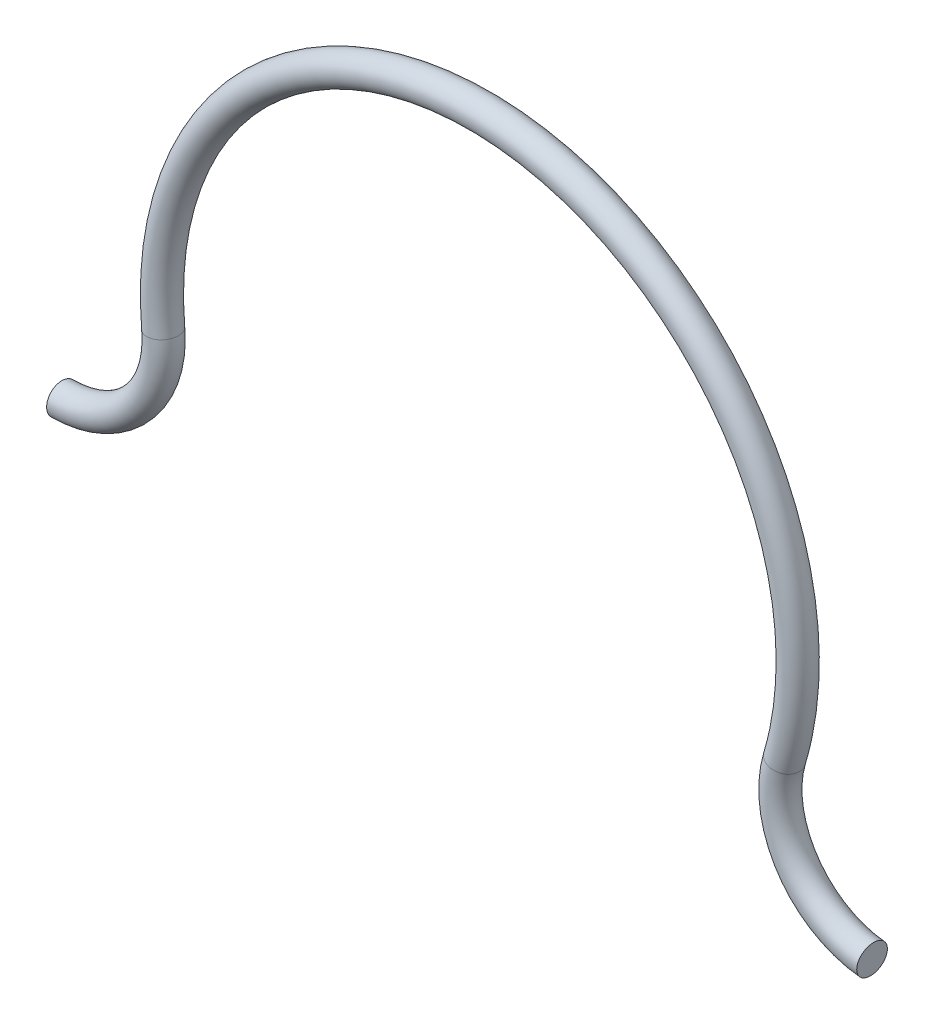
ISO-10303-21;
HEADER;
FILE_DESCRIPTION(('STEP AP214'),'2;1');
FILE_NAME('part.step','',(''),(''),'','','');
FILE_SCHEMA(('AUTOMOTIVE_DESIGN { 1 0 10303 214 1 1 1 1 }'));
ENDSEC;
DATA;
#1=APPLICATION_CONTEXT('core data for automotive mechanical design processes');
#2=APPLICATION_PROTOCOL_DEFINITION('international standard','automotive_design',2000,#1);
#3=PRODUCT_CONTEXT('',#1,'mechanical');
#4=PRODUCT('Part','Part','',(#3));
#5=PRODUCT_RELATED_PRODUCT_CATEGORY('part','',(#4));
#6=PRODUCT_DEFINITION_FORMATION('','',#4);
#7=PRODUCT_DEFINITION_CONTEXT('part definition',#1,'design');
#8=PRODUCT_DEFINITION('design','',#6,#7);
#9=PRODUCT_DEFINITION_SHAPE('','',#8);
#10=(LENGTH_UNIT() NAMED_UNIT(*) SI_UNIT(.MILLI.,.METRE.));
#11=(NAMED_UNIT(*) PLANE_ANGLE_UNIT() SI_UNIT($,.RADIAN.));
#12=(NAMED_UNIT(*) SI_UNIT($,.STERADIAN.) SOLID_ANGLE_UNIT());
#13=UNCERTAINTY_MEASURE_WITH_UNIT(LENGTH_MEASURE(1.E-05),#10,'distance_accuracy_value','');
#14=(GEOMETRIC_REPRESENTATION_CONTEXT(3) GLOBAL_UNCERTAINTY_ASSIGNED_CONTEXT((#13)) GLOBAL_UNIT_ASSIGNED_CONTEXT((#10,
#11,#12)) REPRESENTATION_CONTEXT('',''));
#15=CARTESIAN_POINT('',(0.,0.,0.));
#16=DIRECTION('',(0.,0.,1.));
#17=DIRECTION('',(1.,0.,0.));
#18=AXIS2_PLACEMENT_3D('',#15,#16,#17);
#19=CARTESIAN_POINT('',(805.971377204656,-79.7481080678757,0.));
#20=DIRECTION('',(0.,0.,1.));
#21=DIRECTION('',(1.,0.,0.));
#22=AXIS2_PLACEMENT_3D('',#19,#20,#21);
#23=TOROIDAL_SURFACE('',#22,100.,15.);
#24=CARTESIAN_POINT('',(710.106013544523,-51.2905598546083,0.));
#25=DIRECTION('',(-0.284575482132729,-0.958653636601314,0.));
#26=DIRECTION('',(0.,0.,-1.));
#27=AXIS2_PLACEMENT_3D('',#24,#25,#26);
#28=CIRCLE('',#27,15.);
#29=CARTESIAN_POINT('',(695.726208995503,-47.0219276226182,0.));
#30=VERTEX_POINT('',#29);
#31=EDGE_CURVE('E37',#30,#30,#28,.T.);
#32=CARTESIAN_POINT('',(796.06435810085,-179.256152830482,0.));
#33=DIRECTION('',(0.995080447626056,-0.0990701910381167,0.));
#34=DIRECTION('',(0.,0.,-1.));
#35=AXIS2_PLACEMENT_3D('',#32,#33,#34);
#36=CIRCLE('',#35,15.);
#37=CARTESIAN_POINT('',(794.578305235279,-194.182359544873,0.));
#38=VERTEX_POINT('',#37);
#39=EDGE_CURVE('E10',#38,#38,#36,.T.);
#40=CARTESIAN_POINT('',(805.971377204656,-79.7481080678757,0.));
#41=DIRECTION('',(0.,0.,1.));
#42=DIRECTION('',(1.,0.,0.));
#43=AXIS2_PLACEMENT_3D('',#40,#41,#42);
#44=CIRCLE('',#43,115.);
#45=EDGE_CURVE('',#30,#38,#44,.T.);
#46=ORIENTED_EDGE('',*,*,#31,.T.);
#47=ORIENTED_EDGE('',*,*,#39,.F.);
#48=ORIENTED_EDGE('',*,*,#45,.T.);
#49=ORIENTED_EDGE('',*,*,#45,.F.);
#50=EDGE_LOOP('',(#46,#48,#47,#49));
#51=FACE_BOUND('',#50,.T.);
#52=ADVANCED_FACE('F31',(#51),#23,.T.);
#53=CARTESIAN_POINT('',(410.651697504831,37.6021883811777,0.));
#54=DIRECTION('',(0.,0.,-1.));
#55=DIRECTION('',(-1.,0.,0.));
#56=AXIS2_PLACEMENT_3D('',#53,#54,#55);
#57=TOROIDAL_SURFACE('',#56,312.369665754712,15.);
#58=CARTESIAN_POINT('',(99.5833912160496,9.11856314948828,0.));
#59=DIRECTION('',(-0.0911856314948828,0.995833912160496,0.));
#60=DIRECTION('',(0.,0.,-1.));
#61=AXIS2_PLACEMENT_3D('',#58,#59,#60);
#62=CIRCLE('',#61,15.);
#63=CARTESIAN_POINT('',(114.520899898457,10.4863476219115,0.));
#64=VERTEX_POINT('',#63);
#65=EDGE_CURVE('E41',#64,#64,#62,.T.);
#66=ORIENTED_EDGE('',*,*,#65,.T.);
#67=EDGE_LOOP('',(#66));
#68=FACE_BOUND('',#67,.T.);
#69=ORIENTED_EDGE('',*,*,#31,.F.);
#70=EDGE_LOOP('',(#69));
#71=FACE_BOUND('',#70,.T.);
#72=ADVANCED_FACE('F61',(#68,#71),#57,.T.);
#73=CARTESIAN_POINT('',(0.,0.,0.));
#74=DIRECTION('',(0.,0.,-1.));
#75=DIRECTION('',(-1.,0.,0.));
#76=AXIS2_PLACEMENT_3D('',#73,#74,#75);
#77=TOROIDAL_SURFACE('',#76,100.,15.);
#78=CARTESIAN_POINT('',(0.,-100.,0.));
#79=DIRECTION('',(1.,0.,0.));
#80=DIRECTION('',(0.,0.,-1.));
#81=AXIS2_PLACEMENT_3D('',#78,#79,#80);
#82=CIRCLE('',#81,15.);
#83=CARTESIAN_POINT('',(0.,-115.,0.));
#84=VERTEX_POINT('',#83);
#85=EDGE_CURVE('E45',#84,#84,#82,.T.);
#86=CARTESIAN_POINT('',(0.,0.,0.));
#87=DIRECTION('',(0.,0.,-1.));
#88=DIRECTION('',(-1.,0.,0.));
#89=AXIS2_PLACEMENT_3D('',#86,#87,#88);
#90=CIRCLE('',#89,115.);
#91=EDGE_CURVE('',#64,#84,#90,.T.);
#92=ORIENTED_EDGE('',*,*,#65,.F.);
#93=ORIENTED_EDGE('',*,*,#85,.T.);
#94=ORIENTED_EDGE('',*,*,#91,.T.);
#95=ORIENTED_EDGE('',*,*,#91,.F.);
#96=EDGE_LOOP('',(#92,#94,#93,#95));
#97=FACE_BOUND('',#96,.T.);
#98=ADVANCED_FACE('F51',(#97),#77,.T.);
#99=CARTESIAN_POINT('',(796.06435810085,-179.256152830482,0.));
#100=DIRECTION('',(0.995080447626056,-0.0990701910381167,0.));
#101=DIRECTION('',(0.,0.,-1.));
#102=AXIS2_PLACEMENT_3D('',#99,#100,#101);
#103=PLANE('',#102);
#104=ORIENTED_EDGE('',*,*,#39,.T.);
#105=EDGE_LOOP('',(#104));
#106=FACE_BOUND('',#105,.T.);
#107=ADVANCED_FACE('F55',(#106),#103,.T.);
#108=CARTESIAN_POINT('',(0.,-100.,0.));
#109=DIRECTION('',(1.,0.,0.));
#110=DIRECTION('',(0.,0.,-1.));
#111=AXIS2_PLACEMENT_3D('',#108,#109,#110);
#112=PLANE('',#111);
#113=ORIENTED_EDGE('',*,*,#85,.F.);
#114=EDGE_LOOP('',(#113));
#115=FACE_BOUND('',#114,.T.);
#116=ADVANCED_FACE('F53',(#115),#112,.F.);
#117=CLOSED_SHELL('',(#52,#72,#98,#107,#116));
#118=MANIFOLD_SOLID_BREP('B2',#117);
#119=ADVANCED_BREP_SHAPE_REPRESENTATION('',(#18,#118),#14);
#120=SHAPE_DEFINITION_REPRESENTATION(#9,#119);
ENDSEC;
END-ISO-10303-21;
